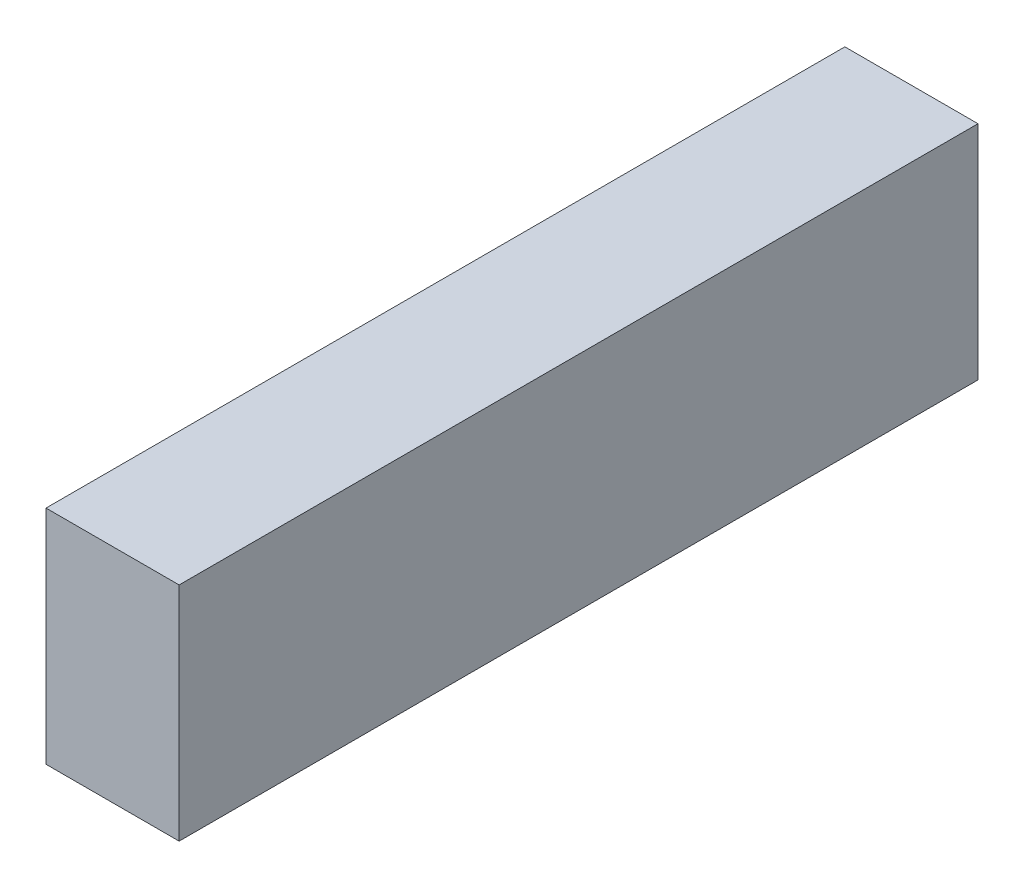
ISO-10303-21;
HEADER;
FILE_DESCRIPTION(('STEP AP214'),'2;1');
FILE_NAME('part.step','',(''),(''),'','','');
FILE_SCHEMA(('AUTOMOTIVE_DESIGN { 1 0 10303 214 1 1 1 1 }'));
ENDSEC;
DATA;
#1=APPLICATION_CONTEXT('core data for automotive mechanical design processes');
#2=APPLICATION_PROTOCOL_DEFINITION('international standard','automotive_design',2000,#1);
#3=PRODUCT_CONTEXT('',#1,'mechanical');
#4=PRODUCT('Part','Part','',(#3));
#5=PRODUCT_RELATED_PRODUCT_CATEGORY('part','',(#4));
#6=PRODUCT_DEFINITION_FORMATION('','',#4);
#7=PRODUCT_DEFINITION_CONTEXT('part definition',#1,'design');
#8=PRODUCT_DEFINITION('design','',#6,#7);
#9=PRODUCT_DEFINITION_SHAPE('','',#8);
#10=(LENGTH_UNIT() NAMED_UNIT(*) SI_UNIT(.MILLI.,.METRE.));
#11=(NAMED_UNIT(*) PLANE_ANGLE_UNIT() SI_UNIT($,.RADIAN.));
#12=(NAMED_UNIT(*) SI_UNIT($,.STERADIAN.) SOLID_ANGLE_UNIT());
#13=UNCERTAINTY_MEASURE_WITH_UNIT(LENGTH_MEASURE(1.E-05),#10,'distance_accuracy_value','');
#14=(GEOMETRIC_REPRESENTATION_CONTEXT(3) GLOBAL_UNCERTAINTY_ASSIGNED_CONTEXT((#13)) GLOBAL_UNIT_ASSIGNED_CONTEXT((#10,
#11,#12)) REPRESENTATION_CONTEXT('',''));
#15=CARTESIAN_POINT('',(0.,0.,0.));
#16=DIRECTION('',(0.,0.,1.));
#17=DIRECTION('',(1.,0.,0.));
#18=AXIS2_PLACEMENT_3D('',#15,#16,#17);
#19=CARTESIAN_POINT('',(15.,4.2750503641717,-4.8266697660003));
#20=DIRECTION('',(0.,0.,-1.));
#21=DIRECTION('',(-1.,0.,0.));
#22=AXIS2_PLACEMENT_3D('',#19,#20,#21);
#23=PLANE('',#22);
#24=DIRECTION('',(0.,-1.,0.));
#25=VECTOR('',#24,1.);
#26=CARTESIAN_POINT('',(0.,4.2750503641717,-4.8266697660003));
#27=LINE('',#26,#25);
#28=CARTESIAN_POINT('',(0.,29.2750503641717,-4.8266697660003));
#29=VERTEX_POINT('',#28);
#30=CARTESIAN_POINT('',(0.,4.2750503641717,-4.8266697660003));
#31=VERTEX_POINT('',#30);
#32=EDGE_CURVE('E86',#29,#31,#27,.T.);
#33=ORIENTED_EDGE('',*,*,#32,.T.);
#34=DIRECTION('',(-1.,0.,0.));
#35=VECTOR('',#34,1.);
#36=CARTESIAN_POINT('',(15.,4.2750503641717,-4.8266697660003));
#37=LINE('',#36,#35);
#38=CARTESIAN_POINT('',(15.,4.2750503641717,-4.8266697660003));
#39=VERTEX_POINT('',#38);
#40=EDGE_CURVE('E12',#39,#31,#37,.T.);
#41=ORIENTED_EDGE('',*,*,#40,.F.);
#42=DIRECTION('',(0.,-1.,0.));
#43=VECTOR('',#42,1.);
#44=CARTESIAN_POINT('',(15.,4.2750503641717,-4.8266697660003));
#45=LINE('',#44,#43);
#46=CARTESIAN_POINT('',(15.,29.2750503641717,-4.8266697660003));
#47=VERTEX_POINT('',#46);
#48=EDGE_CURVE('E105',#47,#39,#45,.T.);
#49=ORIENTED_EDGE('',*,*,#48,.F.);
#50=DIRECTION('',(-1.,0.,0.));
#51=VECTOR('',#50,1.);
#52=CARTESIAN_POINT('',(15.,29.2750503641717,-4.8266697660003));
#53=LINE('',#52,#51);
#54=EDGE_CURVE('E98',#47,#29,#53,.T.);
#55=ORIENTED_EDGE('',*,*,#54,.T.);
#56=EDGE_LOOP('',(#33,#41,#49,#55));
#57=FACE_BOUND('',#56,.T.);
#58=ADVANCED_FACE('F42',(#57),#23,.F.);
#59=CARTESIAN_POINT('',(15.,4.2750503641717,-4.8266697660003));
#60=DIRECTION('',(0.,1.,0.));
#61=DIRECTION('',(0.,0.,1.));
#62=AXIS2_PLACEMENT_3D('',#59,#60,#61);
#63=PLANE('',#62);
#64=DIRECTION('',(0.,0.,-1.));
#65=VECTOR('',#64,1.);
#66=CARTESIAN_POINT('',(0.,4.2750503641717,-4.8266697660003));
#67=LINE('',#66,#65);
#68=CARTESIAN_POINT('',(0.,4.2750503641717,-94.8266697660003));
#69=VERTEX_POINT('',#68);
#70=EDGE_CURVE('E82',#31,#69,#67,.T.);
#71=ORIENTED_EDGE('',*,*,#70,.T.);
#72=DIRECTION('',(-1.,0.,0.));
#73=VECTOR('',#72,1.);
#74=CARTESIAN_POINT('',(15.,4.2750503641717,-94.8266697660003));
#75=LINE('',#74,#73);
#76=CARTESIAN_POINT('',(15.,4.2750503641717,-94.8266697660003));
#77=VERTEX_POINT('',#76);
#78=EDGE_CURVE('E49',#77,#69,#75,.T.);
#79=ORIENTED_EDGE('',*,*,#78,.F.);
#80=DIRECTION('',(0.,0.,-1.));
#81=VECTOR('',#80,1.);
#82=CARTESIAN_POINT('',(15.,4.2750503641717,-4.8266697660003));
#83=LINE('',#82,#81);
#84=EDGE_CURVE('E94',#39,#77,#83,.T.);
#85=ORIENTED_EDGE('',*,*,#84,.F.);
#86=ORIENTED_EDGE('',*,*,#40,.T.);
#87=EDGE_LOOP('',(#71,#79,#85,#86));
#88=FACE_BOUND('',#87,.T.);
#89=ADVANCED_FACE('F93',(#88),#63,.F.);
#90=CARTESIAN_POINT('',(15.,4.2750503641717,-94.8266697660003));
#91=DIRECTION('',(0.,0.,1.));
#92=DIRECTION('',(1.,0.,0.));
#93=AXIS2_PLACEMENT_3D('',#90,#91,#92);
#94=PLANE('',#93);
#95=DIRECTION('',(0.,1.,0.));
#96=VECTOR('',#95,1.);
#97=CARTESIAN_POINT('',(0.,4.2750503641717,-94.8266697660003));
#98=LINE('',#97,#96);
#99=CARTESIAN_POINT('',(0.,29.2750503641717,-94.8266697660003));
#100=VERTEX_POINT('',#99);
#101=EDGE_CURVE('E87',#69,#100,#98,.T.);
#102=ORIENTED_EDGE('',*,*,#101,.T.);
#103=DIRECTION('',(-1.,0.,0.));
#104=VECTOR('',#103,1.);
#105=CARTESIAN_POINT('',(15.,29.2750503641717,-94.8266697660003));
#106=LINE('',#105,#104);
#107=CARTESIAN_POINT('',(15.,29.2750503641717,-94.8266697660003));
#108=VERTEX_POINT('',#107);
#109=EDGE_CURVE('E111',#108,#100,#106,.T.);
#110=ORIENTED_EDGE('',*,*,#109,.F.);
#111=DIRECTION('',(0.,1.,0.));
#112=VECTOR('',#111,1.);
#113=CARTESIAN_POINT('',(15.,4.2750503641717,-94.8266697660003));
#114=LINE('',#113,#112);
#115=EDGE_CURVE('E61',#77,#108,#114,.T.);
#116=ORIENTED_EDGE('',*,*,#115,.F.);
#117=ORIENTED_EDGE('',*,*,#78,.T.);
#118=EDGE_LOOP('',(#102,#110,#116,#117));
#119=FACE_BOUND('',#118,.T.);
#120=ADVANCED_FACE('F114',(#119),#94,.F.);
#121=CARTESIAN_POINT('',(15.,29.2750503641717,-4.8266697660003));
#122=DIRECTION('',(0.,-1.,0.));
#123=DIRECTION('',(0.,0.,-1.));
#124=AXIS2_PLACEMENT_3D('',#121,#122,#123);
#125=PLANE('',#124);
#126=DIRECTION('',(0.,0.,1.));
#127=VECTOR('',#126,1.);
#128=CARTESIAN_POINT('',(0.,29.2750503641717,-4.8266697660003));
#129=LINE('',#128,#127);
#130=EDGE_CURVE('E103',#100,#29,#129,.T.);
#131=ORIENTED_EDGE('',*,*,#130,.T.);
#132=ORIENTED_EDGE('',*,*,#54,.F.);
#133=DIRECTION('',(0.,0.,1.));
#134=VECTOR('',#133,1.);
#135=CARTESIAN_POINT('',(15.,29.2750503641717,-4.8266697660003));
#136=LINE('',#135,#134);
#137=EDGE_CURVE('E56',#108,#47,#136,.T.);
#138=ORIENTED_EDGE('',*,*,#137,.F.);
#139=ORIENTED_EDGE('',*,*,#109,.T.);
#140=EDGE_LOOP('',(#131,#132,#138,#139));
#141=FACE_BOUND('',#140,.T.);
#142=ADVANCED_FACE('F116',(#141),#125,.F.);
#143=CARTESIAN_POINT('',(15.,29.2750503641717,-4.8266697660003));
#144=DIRECTION('',(-1.,0.,0.));
#145=DIRECTION('',(0.,0.,1.));
#146=AXIS2_PLACEMENT_3D('',#143,#144,#145);
#147=PLANE('',#146);
#148=ORIENTED_EDGE('',*,*,#48,.T.);
#149=ORIENTED_EDGE('',*,*,#84,.T.);
#150=ORIENTED_EDGE('',*,*,#115,.T.);
#151=ORIENTED_EDGE('',*,*,#137,.T.);
#152=EDGE_LOOP('',(#148,#149,#150,#151));
#153=FACE_BOUND('',#152,.T.);
#154=ADVANCED_FACE('F117',(#153),#147,.F.);
#155=CARTESIAN_POINT('',(0.,29.2750503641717,-4.8266697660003));
#156=DIRECTION('',(-1.,0.,0.));
#157=DIRECTION('',(0.,0.,1.));
#158=AXIS2_PLACEMENT_3D('',#155,#156,#157);
#159=PLANE('',#158);
#160=ORIENTED_EDGE('',*,*,#32,.F.);
#161=ORIENTED_EDGE('',*,*,#130,.F.);
#162=ORIENTED_EDGE('',*,*,#101,.F.);
#163=ORIENTED_EDGE('',*,*,#70,.F.);
#164=EDGE_LOOP('',(#160,#161,#162,#163));
#165=FACE_BOUND('',#164,.T.);
#166=ADVANCED_FACE('F83',(#165),#159,.T.);
#167=CLOSED_SHELL('',(#58,#89,#120,#142,#154,#166));
#168=MANIFOLD_SOLID_BREP('B2',#167);
#169=ADVANCED_BREP_SHAPE_REPRESENTATION('',(#18,#168),#14);
#170=SHAPE_DEFINITION_REPRESENTATION(#9,#169);
ENDSEC;
END-ISO-10303-21;
